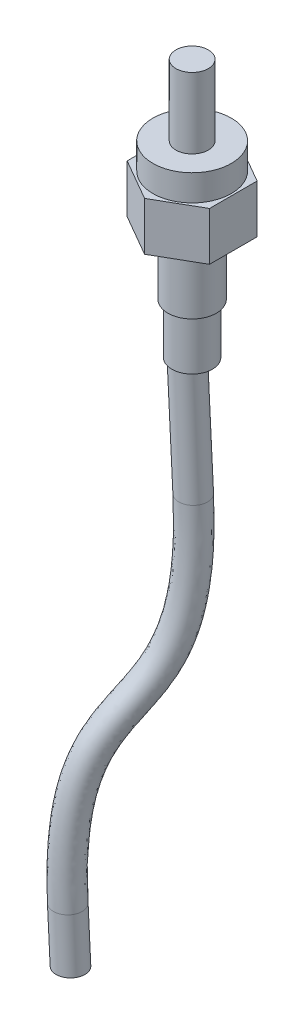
from build123d import *

# Parameters (mm, degrees)
SKETCH1_R      = 1.397
SKETCH2_R      = 1.971875
EXTRUDE1_DEPTH = 4.9
SKETCH3_R      = 2.3495
EXTRUDE2_DEPTH = 6.096
EXTRUDE3_DEPTH = 4.699
SKETCH5_R      = 3.81
EXTRUDE4_DEPTH = 2.54
SKETCH6_R      = 1.5748
EXTRUDE5_DEPTH = 6.858


with BuildPart() as part:
    # Sweep1: sweep along a curve in space
    with BuildLine() as sweep1_path:
        Line((-101.461631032, -201.008519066, 14.829757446), (-101.673096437, -195.781808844, 14.882285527))
        add(Edge.make_bspline(
            [(-96.871968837, -162.625052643, 7.49737935), (-95.997840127, -184.230560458, 7.280245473), (-102.528475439, -174.63973047, 15.09476197), (-101.673096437, -195.781808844, 14.882285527)],
            knots=[0, 0, 0, 0, 1, 1, 1, 1], degree=3))
        Line((-97.33784961, -151.110054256, 7.613104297), (-96.871968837, -162.625052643, 7.49737935))
    # Sketch1 → Sweep1 (sweep)
    with BuildSketch(Plane.XZ.offset(151.110054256)):
        with Locations((-97.33784961, 7.613104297)):
            Circle(SKETCH1_R)
    sweep(path=sweep1_path.line)

    # Sketch2 → Extrude1 (add)
    with BuildSketch(Plane(origin=(0, -151.110054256, 0), x_dir=(1, 0, 0), z_dir=(0, 1, 0))):
        with Locations(Location((-96.863528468, -7.613104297, 0), (0, 0, 180))):
            Circle(SKETCH2_R)
    extrude(amount=EXTRUDE1_DEPTH)

    # Sketch3 → Extrude2 (add)
    with BuildSketch(Plane(origin=(0, -146.210054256, 0), x_dir=(1, 0, 0), z_dir=(0, 1, 0))):
        with Locations((-96.863528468, -7.613104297)):
            Circle(SKETCH3_R)
    extrude(amount=EXTRUDE2_DEPTH)

    # Sketch4 → Extrude3 (add)
    with BuildSketch(Plane(origin=(0, -140.114054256, 0), x_dir=(1, 0, 0), z_dir=(0, 1, 0))):
        Polygon((-96.863528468, -2.993724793), (-100.864028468, -5.303414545), (-100.864028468, -9.922794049), (-96.863528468, -12.232483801), (-92.863028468, -9.922794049), (-92.863028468, -5.303414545), align=None)
    extrude(amount=EXTRUDE3_DEPTH)

    # Sketch5 → Extrude4 (add)
    with BuildSketch(Plane(origin=(0, -135.415054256, 0), x_dir=(1, 0, 0), z_dir=(0, 1, 0))):
        with Locations(Location((-96.863528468, -7.613104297, 0), (0, 0, 180))):
            Circle(SKETCH5_R)
    extrude(amount=EXTRUDE4_DEPTH)

    # Sketch6 → Extrude5 (add)
    with BuildSketch(Plane(origin=(0, -132.875054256, 0), x_dir=(1, 0, 0), z_dir=(0, 1, 0))):
        with Locations(Location((-96.863528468, -7.613104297, 0), (0, 0, 180))):
            Circle(SKETCH6_R)
    extrude(amount=EXTRUDE5_DEPTH)


solid = part.part
